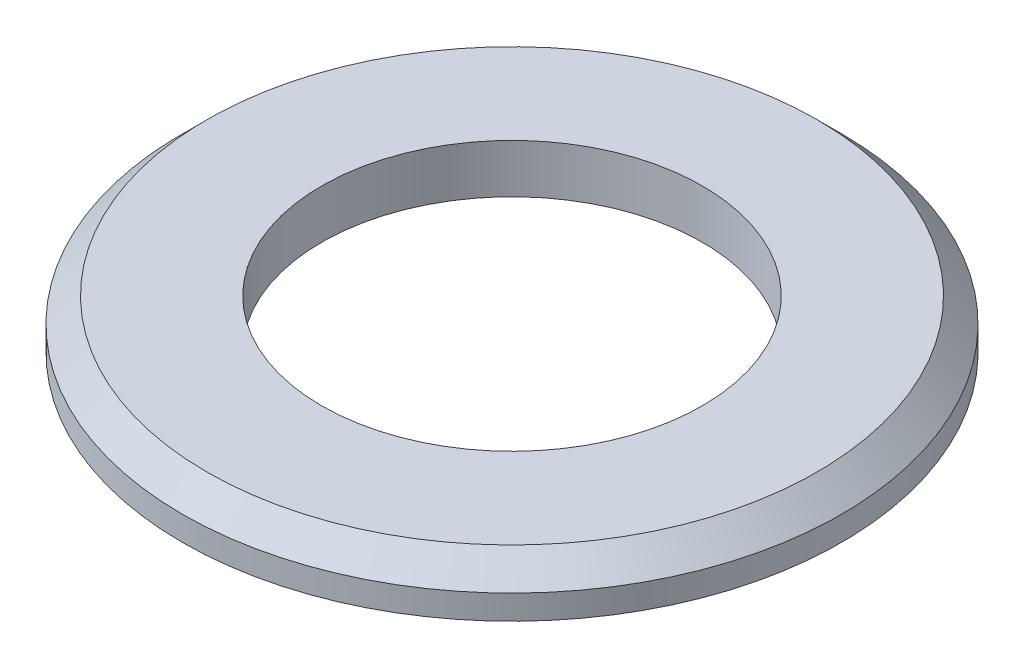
from build123d import *

# Parameters (mm, degrees)
SKETCH1_R      = 67.5
SKETCH1_R_2    = 39
EXTRUDE1_DEPTH = 10
CHAMFER1_SIZE  = 5


with BuildPart() as part:
    # Sketch1 → Extrude1 (new body)
    with BuildSketch(Plane(origin=(0, 0, 0), x_dir=(1, 0, 0), z_dir=(0, 1, 0))):
        with Locations(Location((0, 0, 0), (0, 0, 270))):
            Circle(SKETCH1_R)
        with Locations(Location((0, 0, 0), (0, 0, 270))):
            Circle(SKETCH1_R_2, mode=Mode.SUBTRACT)
    extrude(amount=EXTRUDE1_DEPTH)

    # Chamfer1
    chamfer1_edges = [part.edges().sort_by_distance(p)[0] for p in [
        (0, 10, -67.5),
    ]]
    chamfer(chamfer1_edges, length=CHAMFER1_SIZE)


solid = part.part
